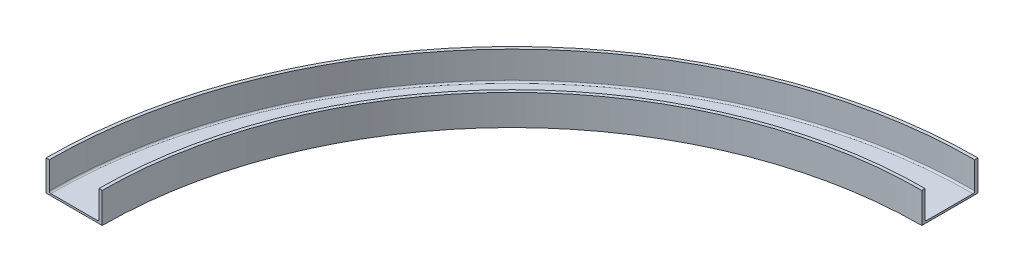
ISO-10303-21;
HEADER;
FILE_DESCRIPTION(('STEP AP214'),'2;1');
FILE_NAME('part.step','',(''),(''),'','','');
FILE_SCHEMA(('AUTOMOTIVE_DESIGN { 1 0 10303 214 1 1 1 1 }'));
ENDSEC;
DATA;
#1=APPLICATION_CONTEXT('core data for automotive mechanical design processes');
#2=APPLICATION_PROTOCOL_DEFINITION('international standard','automotive_design',2000,#1);
#3=PRODUCT_CONTEXT('',#1,'mechanical');
#4=PRODUCT('Part','Part','',(#3));
#5=PRODUCT_RELATED_PRODUCT_CATEGORY('part','',(#4));
#6=PRODUCT_DEFINITION_FORMATION('','',#4);
#7=PRODUCT_DEFINITION_CONTEXT('part definition',#1,'design');
#8=PRODUCT_DEFINITION('design','',#6,#7);
#9=PRODUCT_DEFINITION_SHAPE('','',#8);
#10=(LENGTH_UNIT() NAMED_UNIT(*) SI_UNIT(.MILLI.,.METRE.));
#11=(NAMED_UNIT(*) PLANE_ANGLE_UNIT() SI_UNIT($,.RADIAN.));
#12=(NAMED_UNIT(*) SI_UNIT($,.STERADIAN.) SOLID_ANGLE_UNIT());
#13=UNCERTAINTY_MEASURE_WITH_UNIT(LENGTH_MEASURE(1.E-05),#10,'distance_accuracy_value','');
#14=(GEOMETRIC_REPRESENTATION_CONTEXT(3) GLOBAL_UNCERTAINTY_ASSIGNED_CONTEXT((#13)) GLOBAL_UNIT_ASSIGNED_CONTEXT((#10,
#11,#12)) REPRESENTATION_CONTEXT('',''));
#15=CARTESIAN_POINT('',(0.,0.,0.));
#16=DIRECTION('',(0.,0.,1.));
#17=DIRECTION('',(1.,0.,0.));
#18=AXIS2_PLACEMENT_3D('',#15,#16,#17);
#19=CARTESIAN_POINT('',(-76.2,-41.2749999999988,0.));
#20=DIRECTION('',(0.,-1.,0.));
#21=DIRECTION('',(0.,0.,-1.));
#22=AXIS2_PLACEMENT_3D('',#19,#20,#21);
#23=PLANE('',#22);
#24=CARTESIAN_POINT('',(1186.97,-41.2749999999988,3.5527136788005E-12));
#25=DIRECTION('',(0.,1.,0.));
#26=DIRECTION('',(-1.,0.,0.));
#27=AXIS2_PLACEMENT_3D('',#24,#25,#26);
#28=CIRCLE('',#27,1263.17);
#29=CARTESIAN_POINT('',(1186.97,-41.2749999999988,-1263.17));
#30=VERTEX_POINT('',#29);
#31=CARTESIAN_POINT('',(-76.2,-41.2749999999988,0.));
#32=VERTEX_POINT('',#31);
#33=EDGE_CURVE('E147',#30,#32,#28,.T.);
#34=ORIENTED_EDGE('',*,*,#33,.F.);
#35=DIRECTION('',(0.,0.,1.));
#36=VECTOR('',#35,1.);
#37=CARTESIAN_POINT('',(1186.97,-41.2749999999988,3.5527136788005E-12));
#38=LINE('',#37,#36);
#39=CARTESIAN_POINT('',(1186.97,-41.2749999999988,-1110.77));
#40=VERTEX_POINT('',#39);
#41=EDGE_CURVE('E68',#30,#40,#38,.T.);
#42=ORIENTED_EDGE('',*,*,#41,.T.);
#43=CARTESIAN_POINT('',(1186.97,-41.2749999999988,3.5527136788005E-12));
#44=DIRECTION('',(0.,1.,0.));
#45=DIRECTION('',(-1.,0.,0.));
#46=AXIS2_PLACEMENT_3D('',#43,#44,#45);
#47=CIRCLE('',#46,1110.77);
#48=CARTESIAN_POINT('',(76.2,-41.2749999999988,3.5527136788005E-12));
#49=VERTEX_POINT('',#48);
#50=EDGE_CURVE('E152',#40,#49,#47,.T.);
#51=ORIENTED_EDGE('',*,*,#50,.T.);
#52=DIRECTION('',(1.,0.,0.));
#53=VECTOR('',#52,1.);
#54=CARTESIAN_POINT('',(-76.2,-41.2749999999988,0.));
#55=LINE('',#54,#53);
#56=EDGE_CURVE('E158',#32,#49,#55,.T.);
#57=ORIENTED_EDGE('',*,*,#56,.F.);
#58=EDGE_LOOP('',(#34,#42,#51,#57));
#59=FACE_BOUND('',#58,.T.);
#60=ADVANCED_FACE('F49',(#59),#23,.T.);
#61=CARTESIAN_POINT('',(1186.97,0.,3.5527136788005E-12));
#62=DIRECTION('',(0.,1.,0.));
#63=DIRECTION('',(0.,0.,1.));
#64=AXIS2_PLACEMENT_3D('',#61,#62,#63);
#65=CYLINDRICAL_SURFACE('',#64,1254.28);
#66=DIRECTION('',(0.,1.,0.));
#67=VECTOR('',#66,1.);
#68=CARTESIAN_POINT('',(1186.97,0.,-1254.28));
#69=LINE('',#68,#67);
#70=CARTESIAN_POINT('',(1186.97,41.2749999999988,-1254.28));
#71=VERTEX_POINT('',#70);
#72=CARTESIAN_POINT('',(1186.97,-31.4960000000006,-1254.28));
#73=VERTEX_POINT('',#72);
#74=EDGE_CURVE('E229',#71,#73,#69,.F.);
#75=ORIENTED_EDGE('',*,*,#74,.F.);
#76=CARTESIAN_POINT('',(1186.97,41.2749999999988,3.5527136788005E-12));
#77=DIRECTION('',(0.,1.,0.));
#78=DIRECTION('',(-1.,0.,0.));
#79=AXIS2_PLACEMENT_3D('',#76,#77,#78);
#80=CIRCLE('',#79,1254.28);
#81=CARTESIAN_POINT('',(-67.3099999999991,41.2749999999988,0.));
#82=VERTEX_POINT('',#81);
#83=EDGE_CURVE('E144',#71,#82,#80,.T.);
#84=ORIENTED_EDGE('',*,*,#83,.T.);
#85=DIRECTION('',(0.,1.,0.));
#86=VECTOR('',#85,1.);
#87=CARTESIAN_POINT('',(-67.3100000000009,-31.4960000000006,0.));
#88=LINE('',#87,#86);
#89=CARTESIAN_POINT('',(-67.3099999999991,-31.4960000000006,0.));
#90=VERTEX_POINT('',#89);
#91=EDGE_CURVE('E53',#90,#82,#88,.T.);
#92=ORIENTED_EDGE('',*,*,#91,.F.);
#93=CARTESIAN_POINT('',(1186.97,-31.4960000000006,3.5527136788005E-12));
#94=DIRECTION('',(0.,1.,0.));
#95=DIRECTION('',(-1.,0.,0.));
#96=AXIS2_PLACEMENT_3D('',#93,#94,#95);
#97=CIRCLE('',#96,1254.28);
#98=EDGE_CURVE('E58',#73,#90,#97,.T.);
#99=ORIENTED_EDGE('',*,*,#98,.F.);
#100=EDGE_LOOP('',(#75,#84,#92,#99));
#101=FACE_BOUND('',#100,.T.);
#102=ADVANCED_FACE('F55',(#101),#65,.F.);
#103=CARTESIAN_POINT('',(1186.97,-31.4960000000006,3.5527136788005E-12));
#104=DIRECTION('',(0.,1.,0.));
#105=DIRECTION('',(0.,0.,1.));
#106=AXIS2_PLACEMENT_3D('',#103,#104,#105);
#107=TOROIDAL_SURFACE('',#106,1249.835,4.445);
#108=CARTESIAN_POINT('',(1186.97,-31.4960000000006,-1249.835));
#109=DIRECTION('',(-1.,0.,0.));
#110=DIRECTION('',(0.,0.,1.));
#111=AXIS2_PLACEMENT_3D('',#108,#109,#110);
#112=CIRCLE('',#111,4.445);
#113=CARTESIAN_POINT('',(1186.97,-35.9410000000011,-1249.835));
#114=VERTEX_POINT('',#113);
#115=EDGE_CURVE('E213',#73,#114,#112,.T.);
#116=ORIENTED_EDGE('',*,*,#115,.F.);
#117=ORIENTED_EDGE('',*,*,#98,.T.);
#118=CARTESIAN_POINT('',(-62.8650000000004,-31.4960000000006,0.));
#119=DIRECTION('',(0.,0.,-1.));
#120=DIRECTION('',(-1.,0.,0.));
#121=AXIS2_PLACEMENT_3D('',#118,#119,#120);
#122=CIRCLE('',#121,4.445);
#123=CARTESIAN_POINT('',(-62.8650000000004,-35.9410000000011,0.));
#124=VERTEX_POINT('',#123);
#125=EDGE_CURVE('E198',#124,#90,#122,.T.);
#126=ORIENTED_EDGE('',*,*,#125,.F.);
#127=CARTESIAN_POINT('',(1186.97,-35.9410000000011,3.5527136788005E-12));
#128=DIRECTION('',(0.,1.,0.));
#129=DIRECTION('',(-1.,0.,0.));
#130=AXIS2_PLACEMENT_3D('',#127,#128,#129);
#131=CIRCLE('',#130,1249.835);
#132=EDGE_CURVE('E196',#114,#124,#131,.T.);
#133=ORIENTED_EDGE('',*,*,#132,.F.);
#134=EDGE_LOOP('',(#116,#117,#126,#133));
#135=FACE_BOUND('',#134,.T.);
#136=ADVANCED_FACE('F215',(#135),#107,.F.);
#137=CARTESIAN_POINT('',(62.8650000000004,-35.9410000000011,0.));
#138=DIRECTION('',(0.,1.,0.));
#139=DIRECTION('',(0.,0.,1.));
#140=AXIS2_PLACEMENT_3D('',#137,#138,#139);
#141=PLANE('',#140);
#142=DIRECTION('',(0.,0.,1.));
#143=VECTOR('',#142,1.);
#144=CARTESIAN_POINT('',(1186.97,-35.9410000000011,3.5527136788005E-12));
#145=LINE('',#144,#143);
#146=CARTESIAN_POINT('',(1186.97,-35.9410000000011,-1124.105));
#147=VERTEX_POINT('',#146);
#148=EDGE_CURVE('E232',#114,#147,#145,.T.);
#149=ORIENTED_EDGE('',*,*,#148,.F.);
#150=ORIENTED_EDGE('',*,*,#132,.T.);
#151=DIRECTION('',(-1.,0.,0.));
#152=VECTOR('',#151,1.);
#153=CARTESIAN_POINT('',(62.8650000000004,-35.9410000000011,0.));
#154=LINE('',#153,#152);
#155=CARTESIAN_POINT('',(62.8650000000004,-35.9410000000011,0.));
#156=VERTEX_POINT('',#155);
#157=EDGE_CURVE('E195',#156,#124,#154,.T.);
#158=ORIENTED_EDGE('',*,*,#157,.F.);
#159=CARTESIAN_POINT('',(1186.97,-35.9410000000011,3.5527136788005E-12));
#160=DIRECTION('',(0.,1.,0.));
#161=DIRECTION('',(-1.,0.,0.));
#162=AXIS2_PLACEMENT_3D('',#159,#160,#161);
#163=CIRCLE('',#162,1124.105);
#164=EDGE_CURVE('E186',#147,#156,#163,.T.);
#165=ORIENTED_EDGE('',*,*,#164,.F.);
#166=EDGE_LOOP('',(#149,#150,#158,#165));
#167=FACE_BOUND('',#166,.T.);
#168=ADVANCED_FACE('F291',(#167),#141,.T.);
#169=CARTESIAN_POINT('',(1186.97,-31.4960000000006,3.5527136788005E-12));
#170=DIRECTION('',(0.,1.,0.));
#171=DIRECTION('',(0.,0.,1.));
#172=AXIS2_PLACEMENT_3D('',#169,#170,#171);
#173=TOROIDAL_SURFACE('',#172,1124.105,4.445);
#174=CARTESIAN_POINT('',(1186.97,-31.4960000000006,-1124.105));
#175=DIRECTION('',(-1.,0.,0.));
#176=DIRECTION('',(0.,0.,1.));
#177=AXIS2_PLACEMENT_3D('',#174,#175,#176);
#178=CIRCLE('',#177,4.445);
#179=CARTESIAN_POINT('',(1186.97,-31.4960000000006,-1119.66));
#180=VERTEX_POINT('',#179);
#181=EDGE_CURVE('E237',#147,#180,#178,.T.);
#182=ORIENTED_EDGE('',*,*,#181,.F.);
#183=ORIENTED_EDGE('',*,*,#164,.T.);
#184=CARTESIAN_POINT('',(62.8650000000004,-31.4960000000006,0.));
#185=DIRECTION('',(0.,0.,-1.));
#186=DIRECTION('',(-1.,0.,0.));
#187=AXIS2_PLACEMENT_3D('',#184,#185,#186);
#188=CIRCLE('',#187,4.445);
#189=CARTESIAN_POINT('',(67.3099999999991,-31.4960000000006,0.));
#190=VERTEX_POINT('',#189);
#191=EDGE_CURVE('E184',#190,#156,#188,.T.);
#192=ORIENTED_EDGE('',*,*,#191,.F.);
#193=CARTESIAN_POINT('',(1186.97,-31.4960000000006,3.5527136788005E-12));
#194=DIRECTION('',(0.,1.,0.));
#195=DIRECTION('',(-1.,0.,0.));
#196=AXIS2_PLACEMENT_3D('',#193,#194,#195);
#197=CIRCLE('',#196,1119.66);
#198=EDGE_CURVE('E185',#180,#190,#197,.T.);
#199=ORIENTED_EDGE('',*,*,#198,.F.);
#200=EDGE_LOOP('',(#182,#183,#192,#199));
#201=FACE_BOUND('',#200,.T.);
#202=ADVANCED_FACE('F286',(#201),#173,.F.);
#203=CARTESIAN_POINT('',(1186.97,0.,3.5527136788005E-12));
#204=DIRECTION('',(0.,1.,0.));
#205=DIRECTION('',(0.,0.,1.));
#206=AXIS2_PLACEMENT_3D('',#203,#204,#205);
#207=CYLINDRICAL_SURFACE('',#206,1119.66);
#208=DIRECTION('',(0.,1.,0.));
#209=VECTOR('',#208,1.);
#210=CARTESIAN_POINT('',(1186.97,0.,-1119.66));
#211=LINE('',#210,#209);
#212=CARTESIAN_POINT('',(1186.97,41.2749999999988,-1119.66));
#213=VERTEX_POINT('',#212);
#214=EDGE_CURVE('E243',#180,#213,#211,.T.);
#215=ORIENTED_EDGE('',*,*,#214,.F.);
#216=ORIENTED_EDGE('',*,*,#198,.T.);
#217=DIRECTION('',(0.,-1.,0.));
#218=VECTOR('',#217,1.);
#219=CARTESIAN_POINT('',(67.3100000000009,41.2749999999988,0.));
#220=LINE('',#219,#218);
#221=CARTESIAN_POINT('',(67.3099999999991,41.2749999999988,0.));
#222=VERTEX_POINT('',#221);
#223=EDGE_CURVE('E178',#222,#190,#220,.T.);
#224=ORIENTED_EDGE('',*,*,#223,.F.);
#225=CARTESIAN_POINT('',(1186.97,41.2749999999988,3.5527136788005E-12));
#226=DIRECTION('',(0.,1.,0.));
#227=DIRECTION('',(-1.,0.,0.));
#228=AXIS2_PLACEMENT_3D('',#225,#226,#227);
#229=CIRCLE('',#228,1119.66);
#230=EDGE_CURVE('E174',#213,#222,#229,.T.);
#231=ORIENTED_EDGE('',*,*,#230,.F.);
#232=EDGE_LOOP('',(#215,#216,#224,#231));
#233=FACE_BOUND('',#232,.T.);
#234=ADVANCED_FACE('F287',(#233),#207,.T.);
#235=CARTESIAN_POINT('',(76.2,41.2749999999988,3.5527136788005E-12));
#236=DIRECTION('',(0.,1.,0.));
#237=DIRECTION('',(0.,0.,1.));
#238=AXIS2_PLACEMENT_3D('',#235,#236,#237);
#239=PLANE('',#238);
#240=DIRECTION('',(0.,0.,1.));
#241=VECTOR('',#240,1.);
#242=CARTESIAN_POINT('',(1186.97,41.2749999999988,3.5527136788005E-12));
#243=LINE('',#242,#241);
#244=CARTESIAN_POINT('',(1186.97,41.2749999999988,-1110.77));
#245=VERTEX_POINT('',#244);
#246=EDGE_CURVE('E65',#213,#245,#243,.T.);
#247=ORIENTED_EDGE('',*,*,#246,.F.);
#248=ORIENTED_EDGE('',*,*,#230,.T.);
#249=DIRECTION('',(-1.,0.,0.));
#250=VECTOR('',#249,1.);
#251=CARTESIAN_POINT('',(76.2,41.2749999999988,3.5527136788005E-12));
#252=LINE('',#251,#250);
#253=CARTESIAN_POINT('',(76.2,41.2749999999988,3.5527136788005E-12));
#254=VERTEX_POINT('',#253);
#255=EDGE_CURVE('E171',#254,#222,#252,.T.);
#256=ORIENTED_EDGE('',*,*,#255,.F.);
#257=CARTESIAN_POINT('',(1186.97,41.2749999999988,3.5527136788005E-12));
#258=DIRECTION('',(0.,1.,0.));
#259=DIRECTION('',(-1.,0.,0.));
#260=AXIS2_PLACEMENT_3D('',#257,#258,#259);
#261=CIRCLE('',#260,1110.77);
#262=EDGE_CURVE('E166',#245,#254,#261,.T.);
#263=ORIENTED_EDGE('',*,*,#262,.F.);
#264=EDGE_LOOP('',(#247,#248,#256,#263));
#265=FACE_BOUND('',#264,.T.);
#266=ADVANCED_FACE('F269',(#265),#239,.T.);
#267=CARTESIAN_POINT('',(1186.97,0.,3.5527136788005E-12));
#268=DIRECTION('',(0.,1.,0.));
#269=DIRECTION('',(0.,0.,1.));
#270=AXIS2_PLACEMENT_3D('',#267,#268,#269);
#271=CYLINDRICAL_SURFACE('',#270,1110.77);
#272=DIRECTION('',(0.,1.,0.));
#273=VECTOR('',#272,1.);
#274=CARTESIAN_POINT('',(1186.97,0.,-1110.77));
#275=LINE('',#274,#273);
#276=EDGE_CURVE('E137',#245,#40,#275,.F.);
#277=ORIENTED_EDGE('',*,*,#276,.F.);
#278=ORIENTED_EDGE('',*,*,#262,.T.);
#279=DIRECTION('',(0.,1.,0.));
#280=VECTOR('',#279,1.);
#281=CARTESIAN_POINT('',(76.2,-41.2749999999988,3.5527136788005E-12));
#282=LINE('',#281,#280);
#283=EDGE_CURVE('E165',#49,#254,#282,.T.);
#284=ORIENTED_EDGE('',*,*,#283,.F.);
#285=ORIENTED_EDGE('',*,*,#50,.F.);
#286=EDGE_LOOP('',(#277,#278,#284,#285));
#287=FACE_BOUND('',#286,.T.);
#288=ADVANCED_FACE('F263',(#287),#271,.F.);
#289=CARTESIAN_POINT('',(1186.97,0.,3.5527136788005E-12));
#290=DIRECTION('',(0.,1.,0.));
#291=DIRECTION('',(0.,0.,1.));
#292=AXIS2_PLACEMENT_3D('',#289,#290,#291);
#293=CYLINDRICAL_SURFACE('',#292,1263.17);
#294=DIRECTION('',(0.,1.,0.));
#295=VECTOR('',#294,1.);
#296=CARTESIAN_POINT('',(1186.97,0.,-1263.17));
#297=LINE('',#296,#295);
#298=CARTESIAN_POINT('',(1186.97,41.2749999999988,-1263.17));
#299=VERTEX_POINT('',#298);
#300=EDGE_CURVE('E130',#30,#299,#297,.T.);
#301=ORIENTED_EDGE('',*,*,#300,.F.);
#302=ORIENTED_EDGE('',*,*,#33,.T.);
#303=DIRECTION('',(0.,-1.,0.));
#304=VECTOR('',#303,1.);
#305=CARTESIAN_POINT('',(-76.2,41.2749999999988,0.));
#306=LINE('',#305,#304);
#307=CARTESIAN_POINT('',(-76.2,41.2749999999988,0.));
#308=VERTEX_POINT('',#307);
#309=EDGE_CURVE('E146',#308,#32,#306,.T.);
#310=ORIENTED_EDGE('',*,*,#309,.F.);
#311=CARTESIAN_POINT('',(1186.97,41.2749999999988,3.5527136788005E-12));
#312=DIRECTION('',(0.,1.,0.));
#313=DIRECTION('',(-1.,0.,0.));
#314=AXIS2_PLACEMENT_3D('',#311,#312,#313);
#315=CIRCLE('',#314,1263.17);
#316=EDGE_CURVE('E142',#299,#308,#315,.T.);
#317=ORIENTED_EDGE('',*,*,#316,.F.);
#318=EDGE_LOOP('',(#301,#302,#310,#317));
#319=FACE_BOUND('',#318,.T.);
#320=ADVANCED_FACE('F143',(#319),#293,.T.);
#321=CARTESIAN_POINT('',(-67.3100000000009,41.2749999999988,0.));
#322=DIRECTION('',(0.,1.,0.));
#323=DIRECTION('',(0.,0.,1.));
#324=AXIS2_PLACEMENT_3D('',#321,#322,#323);
#325=PLANE('',#324);
#326=EDGE_CURVE('E12',#299,#71,#243,.T.);
#327=ORIENTED_EDGE('',*,*,#326,.F.);
#328=ORIENTED_EDGE('',*,*,#316,.T.);
#329=DIRECTION('',(-1.,0.,0.));
#330=VECTOR('',#329,1.);
#331=CARTESIAN_POINT('',(-67.3100000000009,41.2749999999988,0.));
#332=LINE('',#331,#330);
#333=EDGE_CURVE('E80',#82,#308,#332,.T.);
#334=ORIENTED_EDGE('',*,*,#333,.F.);
#335=ORIENTED_EDGE('',*,*,#83,.F.);
#336=EDGE_LOOP('',(#327,#328,#334,#335));
#337=FACE_BOUND('',#336,.T.);
#338=ADVANCED_FACE('F138',(#337),#325,.T.);
#339=CARTESIAN_POINT('',(1186.97,-41.2749999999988,3.5527136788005E-12));
#340=DIRECTION('',(-1.,0.,0.));
#341=DIRECTION('',(0.,0.,1.));
#342=AXIS2_PLACEMENT_3D('',#339,#340,#341);
#343=PLANE('',#342);
#344=ORIENTED_EDGE('',*,*,#74,.T.);
#345=ORIENTED_EDGE('',*,*,#115,.T.);
#346=ORIENTED_EDGE('',*,*,#148,.T.);
#347=ORIENTED_EDGE('',*,*,#181,.T.);
#348=ORIENTED_EDGE('',*,*,#214,.T.);
#349=ORIENTED_EDGE('',*,*,#246,.T.);
#350=ORIENTED_EDGE('',*,*,#276,.T.);
#351=ORIENTED_EDGE('',*,*,#41,.F.);
#352=ORIENTED_EDGE('',*,*,#300,.T.);
#353=ORIENTED_EDGE('',*,*,#326,.T.);
#354=EDGE_LOOP('',(#344,#345,#346,#347,#348,#349,#350,#351,#352,#353));
#355=FACE_BOUND('',#354,.T.);
#356=ADVANCED_FACE('F128',(#355),#343,.F.);
#357=CARTESIAN_POINT('',(-450.887453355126,-41.2749999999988,3.5527136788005E-12));
#358=DIRECTION('',(0.,0.,-1.));
#359=DIRECTION('',(-1.,0.,0.));
#360=AXIS2_PLACEMENT_3D('',#357,#358,#359);
#361=PLANE('',#360);
#362=ORIENTED_EDGE('',*,*,#91,.T.);
#363=ORIENTED_EDGE('',*,*,#333,.T.);
#364=ORIENTED_EDGE('',*,*,#309,.T.);
#365=ORIENTED_EDGE('',*,*,#56,.T.);
#366=ORIENTED_EDGE('',*,*,#283,.T.);
#367=ORIENTED_EDGE('',*,*,#255,.T.);
#368=ORIENTED_EDGE('',*,*,#223,.T.);
#369=ORIENTED_EDGE('',*,*,#191,.T.);
#370=ORIENTED_EDGE('',*,*,#157,.T.);
#371=ORIENTED_EDGE('',*,*,#125,.T.);
#372=EDGE_LOOP('',(#362,#363,#364,#365,#366,#367,#368,#369,#370,#371));
#373=FACE_BOUND('',#372,.T.);
#374=ADVANCED_FACE('F266',(#373),#361,.F.);
#375=CLOSED_SHELL('',(#60,#102,#136,#168,#202,#234,#266,#288,#320,#338,#356,#374));
#376=MANIFOLD_SOLID_BREP('B2',#375);
#377=ADVANCED_BREP_SHAPE_REPRESENTATION('',(#18,#376),#14);
#378=SHAPE_DEFINITION_REPRESENTATION(#9,#377);
ENDSEC;
END-ISO-10303-21;
